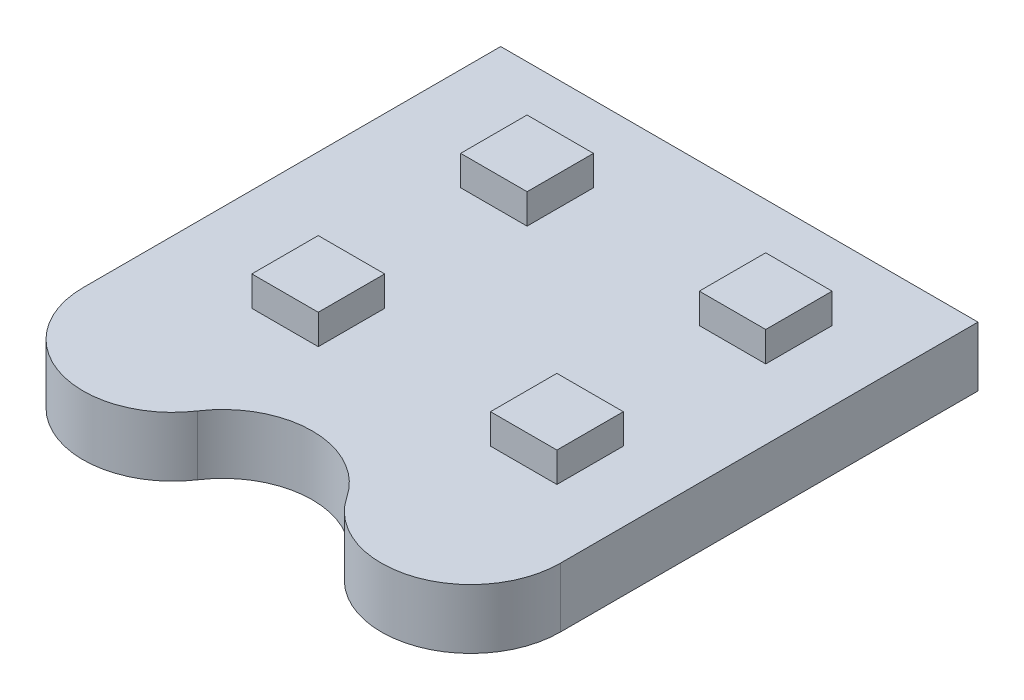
ISO-10303-21;
HEADER;
FILE_DESCRIPTION(('STEP AP214'),'2;1');
FILE_NAME('part.step','',(''),(''),'','','');
FILE_SCHEMA(('AUTOMOTIVE_DESIGN { 1 0 10303 214 1 1 1 1 }'));
ENDSEC;
DATA;
#1=APPLICATION_CONTEXT('core data for automotive mechanical design processes');
#2=APPLICATION_PROTOCOL_DEFINITION('international standard','automotive_design',2000,#1);
#3=PRODUCT_CONTEXT('',#1,'mechanical');
#4=PRODUCT('Part','Part','',(#3));
#5=PRODUCT_RELATED_PRODUCT_CATEGORY('part','',(#4));
#6=PRODUCT_DEFINITION_FORMATION('','',#4);
#7=PRODUCT_DEFINITION_CONTEXT('part definition',#1,'design');
#8=PRODUCT_DEFINITION('design','',#6,#7);
#9=PRODUCT_DEFINITION_SHAPE('','',#8);
#10=(LENGTH_UNIT() NAMED_UNIT(*) SI_UNIT(.MILLI.,.METRE.));
#11=(NAMED_UNIT(*) PLANE_ANGLE_UNIT() SI_UNIT($,.RADIAN.));
#12=(NAMED_UNIT(*) SI_UNIT($,.STERADIAN.) SOLID_ANGLE_UNIT());
#13=UNCERTAINTY_MEASURE_WITH_UNIT(LENGTH_MEASURE(1.E-05),#10,'distance_accuracy_value','');
#14=(GEOMETRIC_REPRESENTATION_CONTEXT(3) GLOBAL_UNCERTAINTY_ASSIGNED_CONTEXT((#13)) GLOBAL_UNIT_ASSIGNED_CONTEXT((#10,
#11,#12)) REPRESENTATION_CONTEXT('',''));
#15=CARTESIAN_POINT('',(0.,0.,0.));
#16=DIRECTION('',(0.,0.,1.));
#17=DIRECTION('',(1.,0.,0.));
#18=AXIS2_PLACEMENT_3D('',#15,#16,#17);
#19=CARTESIAN_POINT('',(19.05,12.7,88.9));
#20=DIRECTION('',(0.,1.,0.));
#21=DIRECTION('',(0.,0.,1.));
#22=AXIS2_PLACEMENT_3D('',#19,#20,#21);
#23=PLANE('',#22);
#24=DIRECTION('',(-1.,0.,0.));
#25=VECTOR('',#24,1.);
#26=CARTESIAN_POINT('',(86.7219282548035,12.7,16.173727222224));
#27=LINE('',#26,#25);
#28=CARTESIAN_POINT('',(86.7219282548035,12.7,16.173727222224));
#29=VERTEX_POINT('',#28);
#30=CARTESIAN_POINT('',(72.5799877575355,12.7,16.173727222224));
#31=VERTEX_POINT('',#30);
#32=EDGE_CURVE('E223',#29,#31,#27,.T.);
#33=ORIENTED_EDGE('',*,*,#32,.F.);
#34=DIRECTION('',(0.,0.,-1.));
#35=VECTOR('',#34,1.);
#36=CARTESIAN_POINT('',(86.7219282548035,12.7,16.173727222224));
#37=LINE('',#36,#35);
#38=CARTESIAN_POINT('',(86.7219282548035,12.7,30.3064055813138));
#39=VERTEX_POINT('',#38);
#40=EDGE_CURVE('E216',#39,#29,#37,.T.);
#41=ORIENTED_EDGE('',*,*,#40,.F.);
#42=DIRECTION('',(1.,0.,0.));
#43=VECTOR('',#42,1.);
#44=CARTESIAN_POINT('',(86.7219282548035,12.7,30.3064055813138));
#45=LINE('',#44,#43);
#46=CARTESIAN_POINT('',(72.5799877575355,12.7,30.3064055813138));
#47=VERTEX_POINT('',#46);
#48=EDGE_CURVE('E228',#47,#39,#45,.T.);
#49=ORIENTED_EDGE('',*,*,#48,.F.);
#50=DIRECTION('',(0.,0.,1.));
#51=VECTOR('',#50,1.);
#52=CARTESIAN_POINT('',(72.5799877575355,12.7,16.173727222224));
#53=LINE('',#52,#51);
#54=EDGE_CURVE('E225',#31,#47,#53,.T.);
#55=ORIENTED_EDGE('',*,*,#54,.F.);
#56=EDGE_LOOP('',(#33,#41,#49,#55));
#57=FACE_BOUND('',#56,.T.);
#58=CARTESIAN_POINT('',(19.05,12.7,88.9));
#59=DIRECTION('',(0.,1.,0.));
#60=DIRECTION('',(0.,0.,1.));
#61=AXIS2_PLACEMENT_3D('',#58,#59,#60);
#62=CIRCLE('',#61,19.05);
#63=CARTESIAN_POINT('',(0.,12.7,88.9));
#64=VERTEX_POINT('',#63);
#65=CARTESIAN_POINT('',(34.925,12.7,99.4302837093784));
#66=VERTEX_POINT('',#65);
#67=EDGE_CURVE('E262',#64,#66,#62,.T.);
#68=ORIENTED_EDGE('',*,*,#67,.T.);
#69=CARTESIAN_POINT('',(50.8,12.7,109.960567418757));
#70=DIRECTION('',(0.,-1.,0.));
#71=DIRECTION('',(0.,0.,-1.));
#72=AXIS2_PLACEMENT_3D('',#69,#70,#71);
#73=CIRCLE('',#72,19.05);
#74=CARTESIAN_POINT('',(66.675,12.7,99.4302837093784));
#75=VERTEX_POINT('',#74);
#76=EDGE_CURVE('E265',#66,#75,#73,.T.);
#77=ORIENTED_EDGE('',*,*,#76,.T.);
#78=CARTESIAN_POINT('',(82.55,12.7,88.9));
#79=DIRECTION('',(0.,1.,0.));
#80=DIRECTION('',(0.,0.,1.));
#81=AXIS2_PLACEMENT_3D('',#78,#79,#80);
#82=CIRCLE('',#81,19.05);
#83=CARTESIAN_POINT('',(101.6,12.7,88.9));
#84=VERTEX_POINT('',#83);
#85=EDGE_CURVE('E267',#75,#84,#82,.T.);
#86=ORIENTED_EDGE('',*,*,#85,.T.);
#87=DIRECTION('',(0.,0.,-1.));
#88=VECTOR('',#87,1.);
#89=CARTESIAN_POINT('',(101.6,12.7,0.));
#90=LINE('',#89,#88);
#91=CARTESIAN_POINT('',(101.6,12.7,0.));
#92=VERTEX_POINT('',#91);
#93=EDGE_CURVE('E269',#84,#92,#90,.T.);
#94=ORIENTED_EDGE('',*,*,#93,.T.);
#95=DIRECTION('',(-1.,0.,0.));
#96=VECTOR('',#95,1.);
#97=CARTESIAN_POINT('',(0.,12.7,0.));
#98=LINE('',#97,#96);
#99=CARTESIAN_POINT('',(0.,12.7,0.));
#100=VERTEX_POINT('',#99);
#101=EDGE_CURVE('E271',#92,#100,#98,.T.);
#102=ORIENTED_EDGE('',*,*,#101,.T.);
#103=DIRECTION('',(0.,0.,1.));
#104=VECTOR('',#103,1.);
#105=CARTESIAN_POINT('',(0.,12.7,88.9));
#106=LINE('',#105,#104);
#107=EDGE_CURVE('E273',#100,#64,#106,.T.);
#108=ORIENTED_EDGE('',*,*,#107,.T.);
#109=EDGE_LOOP('',(#68,#77,#86,#94,#102,#108));
#110=FACE_BOUND('',#109,.T.);
#111=DIRECTION('',(-1.,0.,0.));
#112=VECTOR('',#111,1.);
#113=CARTESIAN_POINT('',(86.7219282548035,12.7,60.623727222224));
#114=LINE('',#113,#112);
#115=CARTESIAN_POINT('',(86.7219282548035,12.7,60.623727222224));
#116=VERTEX_POINT('',#115);
#117=CARTESIAN_POINT('',(72.5799877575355,12.7,60.623727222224));
#118=VERTEX_POINT('',#117);
#119=EDGE_CURVE('E214',#116,#118,#114,.T.);
#120=ORIENTED_EDGE('',*,*,#119,.F.);
#121=DIRECTION('',(0.,0.,-1.));
#122=VECTOR('',#121,1.);
#123=CARTESIAN_POINT('',(86.7219282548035,12.7,60.623727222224));
#124=LINE('',#123,#122);
#125=CARTESIAN_POINT('',(86.7219282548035,12.7,74.7564055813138));
#126=VERTEX_POINT('',#125);
#127=EDGE_CURVE('E212',#126,#116,#124,.T.);
#128=ORIENTED_EDGE('',*,*,#127,.F.);
#129=DIRECTION('',(1.,0.,0.));
#130=VECTOR('',#129,1.);
#131=CARTESIAN_POINT('',(86.7219282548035,12.7,74.7564055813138));
#132=LINE('',#131,#130);
#133=CARTESIAN_POINT('',(72.5799877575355,12.7,74.7564055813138));
#134=VERTEX_POINT('',#133);
#135=EDGE_CURVE('E199',#134,#126,#132,.T.);
#136=ORIENTED_EDGE('',*,*,#135,.F.);
#137=DIRECTION('',(0.,0.,1.));
#138=VECTOR('',#137,1.);
#139=CARTESIAN_POINT('',(72.5799877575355,12.7,60.623727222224));
#140=LINE('',#139,#138);
#141=EDGE_CURVE('E604',#118,#134,#140,.T.);
#142=ORIENTED_EDGE('',*,*,#141,.F.);
#143=EDGE_LOOP('',(#120,#128,#136,#142));
#144=FACE_BOUND('',#143,.T.);
#145=DIRECTION('',(0.,0.,-1.));
#146=VECTOR('',#145,1.);
#147=CARTESIAN_POINT('',(35.9219282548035,12.7,16.173727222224));
#148=LINE('',#147,#146);
#149=CARTESIAN_POINT('',(35.9219282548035,12.7,30.3064055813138));
#150=VERTEX_POINT('',#149);
#151=CARTESIAN_POINT('',(35.9219282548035,12.7,16.173727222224));
#152=VERTEX_POINT('',#151);
#153=EDGE_CURVE('E293',#150,#152,#148,.T.);
#154=ORIENTED_EDGE('',*,*,#153,.F.);
#155=DIRECTION('',(1.,0.,0.));
#156=VECTOR('',#155,1.);
#157=CARTESIAN_POINT('',(35.9219282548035,12.7,30.3064055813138));
#158=LINE('',#157,#156);
#159=CARTESIAN_POINT('',(21.7799877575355,12.7,30.3064055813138));
#160=VERTEX_POINT('',#159);
#161=EDGE_CURVE('E295',#160,#150,#158,.T.);
#162=ORIENTED_EDGE('',*,*,#161,.F.);
#163=DIRECTION('',(0.,0.,1.));
#164=VECTOR('',#163,1.);
#165=CARTESIAN_POINT('',(21.7799877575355,12.7,16.173727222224));
#166=LINE('',#165,#164);
#167=CARTESIAN_POINT('',(21.7799877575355,12.7,16.173727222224));
#168=VERTEX_POINT('',#167);
#169=EDGE_CURVE('E298',#168,#160,#166,.T.);
#170=ORIENTED_EDGE('',*,*,#169,.F.);
#171=DIRECTION('',(-1.,0.,0.));
#172=VECTOR('',#171,1.);
#173=CARTESIAN_POINT('',(35.9219282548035,12.7,16.173727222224));
#174=LINE('',#173,#172);
#175=EDGE_CURVE('E301',#152,#168,#174,.T.);
#176=ORIENTED_EDGE('',*,*,#175,.F.);
#177=EDGE_LOOP('',(#154,#162,#170,#176));
#178=FACE_BOUND('',#177,.T.);
#179=DIRECTION('',(0.,0.,-1.));
#180=VECTOR('',#179,1.);
#181=CARTESIAN_POINT('',(35.9219282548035,12.7,60.623727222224));
#182=LINE('',#181,#180);
#183=CARTESIAN_POINT('',(35.9219282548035,12.7,74.7564055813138));
#184=VERTEX_POINT('',#183);
#185=CARTESIAN_POINT('',(35.9219282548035,12.7,60.623727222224));
#186=VERTEX_POINT('',#185);
#187=EDGE_CURVE('E328',#184,#186,#182,.T.);
#188=ORIENTED_EDGE('',*,*,#187,.F.);
#189=DIRECTION('',(1.,0.,0.));
#190=VECTOR('',#189,1.);
#191=CARTESIAN_POINT('',(35.9219282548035,12.7,74.7564055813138));
#192=LINE('',#191,#190);
#193=CARTESIAN_POINT('',(21.7799877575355,12.7,74.7564055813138));
#194=VERTEX_POINT('',#193);
#195=EDGE_CURVE('E330',#194,#184,#192,.T.);
#196=ORIENTED_EDGE('',*,*,#195,.F.);
#197=DIRECTION('',(0.,0.,1.));
#198=VECTOR('',#197,1.);
#199=CARTESIAN_POINT('',(21.7799877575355,12.7,60.623727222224));
#200=LINE('',#199,#198);
#201=CARTESIAN_POINT('',(21.7799877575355,12.7,60.623727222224));
#202=VERTEX_POINT('',#201);
#203=EDGE_CURVE('E333',#202,#194,#200,.T.);
#204=ORIENTED_EDGE('',*,*,#203,.F.);
#205=DIRECTION('',(-1.,0.,0.));
#206=VECTOR('',#205,1.);
#207=CARTESIAN_POINT('',(35.9219282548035,12.7,60.623727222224));
#208=LINE('',#207,#206);
#209=EDGE_CURVE('E335',#186,#202,#208,.T.);
#210=ORIENTED_EDGE('',*,*,#209,.F.);
#211=EDGE_LOOP('',(#188,#196,#204,#210));
#212=FACE_BOUND('',#211,.T.);
#213=ADVANCED_FACE('F36',(#57,#110,#144,#178,#212),#23,.T.);
#214=CARTESIAN_POINT('',(19.05,12.7,88.9));
#215=DIRECTION('',(0.,-1.,0.));
#216=DIRECTION('',(0.,0.,-1.));
#217=AXIS2_PLACEMENT_3D('',#214,#215,#216);
#218=CYLINDRICAL_SURFACE('',#217,19.05);
#219=CARTESIAN_POINT('',(19.05,0.,88.9));
#220=DIRECTION('',(0.,1.,0.));
#221=DIRECTION('',(0.,0.,1.));
#222=AXIS2_PLACEMENT_3D('',#219,#220,#221);
#223=CIRCLE('',#222,19.05);
#224=CARTESIAN_POINT('',(0.,0.,88.9));
#225=VERTEX_POINT('',#224);
#226=CARTESIAN_POINT('',(34.925,0.,99.4302837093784));
#227=VERTEX_POINT('',#226);
#228=EDGE_CURVE('E249',#225,#227,#223,.T.);
#229=ORIENTED_EDGE('',*,*,#228,.T.);
#230=DIRECTION('',(0.,-1.,0.));
#231=VECTOR('',#230,1.);
#232=CARTESIAN_POINT('',(34.925,12.7,99.4302837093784));
#233=LINE('',#232,#231);
#234=EDGE_CURVE('E290',#66,#227,#233,.T.);
#235=ORIENTED_EDGE('',*,*,#234,.F.);
#236=ORIENTED_EDGE('',*,*,#67,.F.);
#237=DIRECTION('',(0.,-1.,0.));
#238=VECTOR('',#237,1.);
#239=CARTESIAN_POINT('',(0.,12.7,88.9));
#240=LINE('',#239,#238);
#241=EDGE_CURVE('E275',#64,#225,#240,.T.);
#242=ORIENTED_EDGE('',*,*,#241,.T.);
#243=EDGE_LOOP('',(#229,#235,#236,#242));
#244=FACE_BOUND('',#243,.T.);
#245=ADVANCED_FACE('F361',(#244),#218,.T.);
#246=CARTESIAN_POINT('',(50.8,12.7,109.960567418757));
#247=DIRECTION('',(0.,-1.,0.));
#248=DIRECTION('',(0.,0.,-1.));
#249=AXIS2_PLACEMENT_3D('',#246,#247,#248);
#250=CYLINDRICAL_SURFACE('',#249,19.05);
#251=CARTESIAN_POINT('',(50.8,0.,109.960567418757));
#252=DIRECTION('',(0.,-1.,0.));
#253=DIRECTION('',(0.,0.,-1.));
#254=AXIS2_PLACEMENT_3D('',#251,#252,#253);
#255=CIRCLE('',#254,19.05);
#256=CARTESIAN_POINT('',(66.675,0.,99.4302837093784));
#257=VERTEX_POINT('',#256);
#258=EDGE_CURVE('E252',#227,#257,#255,.T.);
#259=ORIENTED_EDGE('',*,*,#258,.T.);
#260=DIRECTION('',(0.,-1.,0.));
#261=VECTOR('',#260,1.);
#262=CARTESIAN_POINT('',(66.675,12.7,99.4302837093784));
#263=LINE('',#262,#261);
#264=EDGE_CURVE('E287',#75,#257,#263,.T.);
#265=ORIENTED_EDGE('',*,*,#264,.F.);
#266=ORIENTED_EDGE('',*,*,#76,.F.);
#267=ORIENTED_EDGE('',*,*,#234,.T.);
#268=EDGE_LOOP('',(#259,#265,#266,#267));
#269=FACE_BOUND('',#268,.T.);
#270=ADVANCED_FACE('F369',(#269),#250,.F.);
#271=CARTESIAN_POINT('',(82.55,12.7,88.9));
#272=DIRECTION('',(0.,-1.,0.));
#273=DIRECTION('',(0.,0.,-1.));
#274=AXIS2_PLACEMENT_3D('',#271,#272,#273);
#275=CYLINDRICAL_SURFACE('',#274,19.05);
#276=CARTESIAN_POINT('',(82.55,0.,88.9));
#277=DIRECTION('',(0.,1.,0.));
#278=DIRECTION('',(0.,0.,1.));
#279=AXIS2_PLACEMENT_3D('',#276,#277,#278);
#280=CIRCLE('',#279,19.05);
#281=CARTESIAN_POINT('',(101.6,0.,88.9));
#282=VERTEX_POINT('',#281);
#283=EDGE_CURVE('E254',#257,#282,#280,.T.);
#284=ORIENTED_EDGE('',*,*,#283,.T.);
#285=DIRECTION('',(0.,-1.,0.));
#286=VECTOR('',#285,1.);
#287=CARTESIAN_POINT('',(101.6,12.7,88.9));
#288=LINE('',#287,#286);
#289=EDGE_CURVE('E284',#84,#282,#288,.T.);
#290=ORIENTED_EDGE('',*,*,#289,.F.);
#291=ORIENTED_EDGE('',*,*,#85,.F.);
#292=ORIENTED_EDGE('',*,*,#264,.T.);
#293=EDGE_LOOP('',(#284,#290,#291,#292));
#294=FACE_BOUND('',#293,.T.);
#295=ADVANCED_FACE('F389',(#294),#275,.T.);
#296=CARTESIAN_POINT('',(101.6,12.7,0.));
#297=DIRECTION('',(-1.,0.,0.));
#298=DIRECTION('',(0.,0.,1.));
#299=AXIS2_PLACEMENT_3D('',#296,#297,#298);
#300=PLANE('',#299);
#301=DIRECTION('',(0.,0.,-1.));
#302=VECTOR('',#301,1.);
#303=CARTESIAN_POINT('',(101.6,0.,0.));
#304=LINE('',#303,#302);
#305=CARTESIAN_POINT('',(101.6,0.,0.));
#306=VERTEX_POINT('',#305);
#307=EDGE_CURVE('E256',#282,#306,#304,.T.);
#308=ORIENTED_EDGE('',*,*,#307,.T.);
#309=DIRECTION('',(0.,-1.,0.));
#310=VECTOR('',#309,1.);
#311=CARTESIAN_POINT('',(101.6,12.7,0.));
#312=LINE('',#311,#310);
#313=EDGE_CURVE('E281',#92,#306,#312,.T.);
#314=ORIENTED_EDGE('',*,*,#313,.F.);
#315=ORIENTED_EDGE('',*,*,#93,.F.);
#316=ORIENTED_EDGE('',*,*,#289,.T.);
#317=EDGE_LOOP('',(#308,#314,#315,#316));
#318=FACE_BOUND('',#317,.T.);
#319=ADVANCED_FACE('F385',(#318),#300,.F.);
#320=CARTESIAN_POINT('',(0.,12.7,0.));
#321=DIRECTION('',(0.,0.,1.));
#322=DIRECTION('',(1.,0.,0.));
#323=AXIS2_PLACEMENT_3D('',#320,#321,#322);
#324=PLANE('',#323);
#325=DIRECTION('',(-1.,0.,0.));
#326=VECTOR('',#325,1.);
#327=CARTESIAN_POINT('',(0.,0.,0.));
#328=LINE('',#327,#326);
#329=CARTESIAN_POINT('',(0.,0.,0.));
#330=VERTEX_POINT('',#329);
#331=EDGE_CURVE('E258',#306,#330,#328,.T.);
#332=ORIENTED_EDGE('',*,*,#331,.T.);
#333=DIRECTION('',(0.,-1.,0.));
#334=VECTOR('',#333,1.);
#335=CARTESIAN_POINT('',(0.,12.7,0.));
#336=LINE('',#335,#334);
#337=EDGE_CURVE('E278',#100,#330,#336,.T.);
#338=ORIENTED_EDGE('',*,*,#337,.F.);
#339=ORIENTED_EDGE('',*,*,#101,.F.);
#340=ORIENTED_EDGE('',*,*,#313,.T.);
#341=EDGE_LOOP('',(#332,#338,#339,#340));
#342=FACE_BOUND('',#341,.T.);
#343=ADVANCED_FACE('F381',(#342),#324,.F.);
#344=CARTESIAN_POINT('',(0.,12.7,88.9));
#345=DIRECTION('',(1.,0.,0.));
#346=DIRECTION('',(0.,0.,-1.));
#347=AXIS2_PLACEMENT_3D('',#344,#345,#346);
#348=PLANE('',#347);
#349=DIRECTION('',(0.,0.,1.));
#350=VECTOR('',#349,1.);
#351=CARTESIAN_POINT('',(0.,0.,88.9));
#352=LINE('',#351,#350);
#353=EDGE_CURVE('E260',#330,#225,#352,.T.);
#354=ORIENTED_EDGE('',*,*,#353,.T.);
#355=ORIENTED_EDGE('',*,*,#241,.F.);
#356=ORIENTED_EDGE('',*,*,#107,.F.);
#357=ORIENTED_EDGE('',*,*,#337,.T.);
#358=EDGE_LOOP('',(#354,#355,#356,#357));
#359=FACE_BOUND('',#358,.T.);
#360=ADVANCED_FACE('F378',(#359),#348,.F.);
#361=CARTESIAN_POINT('',(19.05,0.,88.9));
#362=DIRECTION('',(0.,1.,0.));
#363=DIRECTION('',(0.,0.,1.));
#364=AXIS2_PLACEMENT_3D('',#361,#362,#363);
#365=PLANE('',#364);
#366=ORIENTED_EDGE('',*,*,#228,.F.);
#367=ORIENTED_EDGE('',*,*,#353,.F.);
#368=ORIENTED_EDGE('',*,*,#331,.F.);
#369=ORIENTED_EDGE('',*,*,#307,.F.);
#370=ORIENTED_EDGE('',*,*,#283,.F.);
#371=ORIENTED_EDGE('',*,*,#258,.F.);
#372=EDGE_LOOP('',(#366,#367,#368,#369,#370,#371));
#373=FACE_BOUND('',#372,.T.);
#374=ADVANCED_FACE('F376',(#373),#365,.F.);
#375=CARTESIAN_POINT('',(86.7219282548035,19.05,16.173727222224));
#376=DIRECTION('',(-1.,0.,0.));
#377=DIRECTION('',(0.,0.,1.));
#378=AXIS2_PLACEMENT_3D('',#375,#376,#377);
#379=PLANE('',#378);
#380=ORIENTED_EDGE('',*,*,#40,.T.);
#381=DIRECTION('',(0.,-1.,0.));
#382=VECTOR('',#381,1.);
#383=CARTESIAN_POINT('',(86.7219282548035,19.05,16.173727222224));
#384=LINE('',#383,#382);
#385=CARTESIAN_POINT('',(86.7219282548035,19.05,16.173727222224));
#386=VERTEX_POINT('',#385);
#387=EDGE_CURVE('E247',#386,#29,#384,.T.);
#388=ORIENTED_EDGE('',*,*,#387,.F.);
#389=DIRECTION('',(0.,0.,-1.));
#390=VECTOR('',#389,1.);
#391=CARTESIAN_POINT('',(86.7219282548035,19.05,16.173727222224));
#392=LINE('',#391,#390);
#393=CARTESIAN_POINT('',(86.7219282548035,19.05,30.3064055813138));
#394=VERTEX_POINT('',#393);
#395=EDGE_CURVE('E230',#394,#386,#392,.T.);
#396=ORIENTED_EDGE('',*,*,#395,.F.);
#397=DIRECTION('',(0.,-1.,0.));
#398=VECTOR('',#397,1.);
#399=CARTESIAN_POINT('',(86.7219282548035,19.05,30.3064055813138));
#400=LINE('',#399,#398);
#401=EDGE_CURVE('E239',#394,#39,#400,.T.);
#402=ORIENTED_EDGE('',*,*,#401,.T.);
#403=EDGE_LOOP('',(#380,#388,#396,#402));
#404=FACE_BOUND('',#403,.T.);
#405=ADVANCED_FACE('F528',(#404),#379,.F.);
#406=CARTESIAN_POINT('',(86.7219282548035,19.05,16.173727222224));
#407=DIRECTION('',(0.,0.,1.));
#408=DIRECTION('',(1.,0.,0.));
#409=AXIS2_PLACEMENT_3D('',#406,#407,#408);
#410=PLANE('',#409);
#411=ORIENTED_EDGE('',*,*,#32,.T.);
#412=DIRECTION('',(0.,-1.,0.));
#413=VECTOR('',#412,1.);
#414=CARTESIAN_POINT('',(72.5799877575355,19.05,16.173727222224));
#415=LINE('',#414,#413);
#416=CARTESIAN_POINT('',(72.5799877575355,19.05,16.173727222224));
#417=VERTEX_POINT('',#416);
#418=EDGE_CURVE('E244',#417,#31,#415,.T.);
#419=ORIENTED_EDGE('',*,*,#418,.F.);
#420=DIRECTION('',(-1.,0.,0.));
#421=VECTOR('',#420,1.);
#422=CARTESIAN_POINT('',(86.7219282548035,19.05,16.173727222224));
#423=LINE('',#422,#421);
#424=EDGE_CURVE('E233',#386,#417,#423,.T.);
#425=ORIENTED_EDGE('',*,*,#424,.F.);
#426=ORIENTED_EDGE('',*,*,#387,.T.);
#427=EDGE_LOOP('',(#411,#419,#425,#426));
#428=FACE_BOUND('',#427,.T.);
#429=ADVANCED_FACE('F520',(#428),#410,.F.);
#430=CARTESIAN_POINT('',(72.5799877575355,19.05,16.173727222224));
#431=DIRECTION('',(1.,0.,0.));
#432=DIRECTION('',(0.,0.,-1.));
#433=AXIS2_PLACEMENT_3D('',#430,#431,#432);
#434=PLANE('',#433);
#435=ORIENTED_EDGE('',*,*,#54,.T.);
#436=DIRECTION('',(0.,-1.,0.));
#437=VECTOR('',#436,1.);
#438=CARTESIAN_POINT('',(72.5799877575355,19.05,30.3064055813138));
#439=LINE('',#438,#437);
#440=CARTESIAN_POINT('',(72.5799877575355,19.05,30.3064055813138));
#441=VERTEX_POINT('',#440);
#442=EDGE_CURVE('E242',#441,#47,#439,.T.);
#443=ORIENTED_EDGE('',*,*,#442,.F.);
#444=DIRECTION('',(0.,0.,1.));
#445=VECTOR('',#444,1.);
#446=CARTESIAN_POINT('',(72.5799877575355,19.05,16.173727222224));
#447=LINE('',#446,#445);
#448=EDGE_CURVE('E235',#417,#441,#447,.T.);
#449=ORIENTED_EDGE('',*,*,#448,.F.);
#450=ORIENTED_EDGE('',*,*,#418,.T.);
#451=EDGE_LOOP('',(#435,#443,#449,#450));
#452=FACE_BOUND('',#451,.T.);
#453=ADVANCED_FACE('F512',(#452),#434,.F.);
#454=CARTESIAN_POINT('',(86.7219282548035,19.05,30.3064055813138));
#455=DIRECTION('',(0.,0.,-1.));
#456=DIRECTION('',(-1.,0.,0.));
#457=AXIS2_PLACEMENT_3D('',#454,#455,#456);
#458=PLANE('',#457);
#459=ORIENTED_EDGE('',*,*,#48,.T.);
#460=ORIENTED_EDGE('',*,*,#401,.F.);
#461=DIRECTION('',(1.,0.,0.));
#462=VECTOR('',#461,1.);
#463=CARTESIAN_POINT('',(86.7219282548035,19.05,30.3064055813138));
#464=LINE('',#463,#462);
#465=EDGE_CURVE('E237',#441,#394,#464,.T.);
#466=ORIENTED_EDGE('',*,*,#465,.F.);
#467=ORIENTED_EDGE('',*,*,#442,.T.);
#468=EDGE_LOOP('',(#459,#460,#466,#467));
#469=FACE_BOUND('',#468,.T.);
#470=ADVANCED_FACE('F505',(#469),#458,.F.);
#471=CARTESIAN_POINT('',(86.7219282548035,19.05,30.3064055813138));
#472=DIRECTION('',(0.,-1.,0.));
#473=DIRECTION('',(0.,0.,-1.));
#474=AXIS2_PLACEMENT_3D('',#471,#472,#473);
#475=PLANE('',#474);
#476=ORIENTED_EDGE('',*,*,#395,.T.);
#477=ORIENTED_EDGE('',*,*,#424,.T.);
#478=ORIENTED_EDGE('',*,*,#448,.T.);
#479=ORIENTED_EDGE('',*,*,#465,.T.);
#480=EDGE_LOOP('',(#476,#477,#478,#479));
#481=FACE_BOUND('',#480,.T.);
#482=ADVANCED_FACE('F456',(#481),#475,.F.);
#483=CARTESIAN_POINT('',(86.7219282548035,19.05,60.623727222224));
#484=DIRECTION('',(-1.,0.,0.));
#485=DIRECTION('',(0.,0.,1.));
#486=AXIS2_PLACEMENT_3D('',#483,#484,#485);
#487=PLANE('',#486);
#488=ORIENTED_EDGE('',*,*,#127,.T.);
#489=DIRECTION('',(0.,-1.,0.));
#490=VECTOR('',#489,1.);
#491=CARTESIAN_POINT('',(86.7219282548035,19.05,60.623727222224));
#492=LINE('',#491,#490);
#493=CARTESIAN_POINT('',(86.7219282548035,19.05,60.623727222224));
#494=VERTEX_POINT('',#493);
#495=EDGE_CURVE('E205',#494,#116,#492,.T.);
#496=ORIENTED_EDGE('',*,*,#495,.F.);
#497=DIRECTION('',(0.,0.,-1.));
#498=VECTOR('',#497,1.);
#499=CARTESIAN_POINT('',(86.7219282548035,19.05,60.623727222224));
#500=LINE('',#499,#498);
#501=CARTESIAN_POINT('',(86.7219282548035,19.05,74.7564055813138));
#502=VERTEX_POINT('',#501);
#503=EDGE_CURVE('E188',#502,#494,#500,.T.);
#504=ORIENTED_EDGE('',*,*,#503,.F.);
#505=DIRECTION('',(0.,-1.,0.));
#506=VECTOR('',#505,1.);
#507=CARTESIAN_POINT('',(86.7219282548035,19.05,74.7564055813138));
#508=LINE('',#507,#506);
#509=EDGE_CURVE('E609',#502,#126,#508,.T.);
#510=ORIENTED_EDGE('',*,*,#509,.T.);
#511=EDGE_LOOP('',(#488,#496,#504,#510));
#512=FACE_BOUND('',#511,.T.);
#513=ADVANCED_FACE('F210',(#512),#487,.F.);
#514=CARTESIAN_POINT('',(86.7219282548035,19.05,60.623727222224));
#515=DIRECTION('',(0.,0.,1.));
#516=DIRECTION('',(1.,0.,0.));
#517=AXIS2_PLACEMENT_3D('',#514,#515,#516);
#518=PLANE('',#517);
#519=ORIENTED_EDGE('',*,*,#119,.T.);
#520=DIRECTION('',(0.,-1.,0.));
#521=VECTOR('',#520,1.);
#522=CARTESIAN_POINT('',(72.5799877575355,19.05,60.623727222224));
#523=LINE('',#522,#521);
#524=CARTESIAN_POINT('',(72.5799877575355,19.05,60.623727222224));
#525=VERTEX_POINT('',#524);
#526=EDGE_CURVE('E207',#525,#118,#523,.T.);
#527=ORIENTED_EDGE('',*,*,#526,.F.);
#528=DIRECTION('',(-1.,0.,0.));
#529=VECTOR('',#528,1.);
#530=CARTESIAN_POINT('',(86.7219282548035,19.05,60.623727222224));
#531=LINE('',#530,#529);
#532=EDGE_CURVE('E191',#494,#525,#531,.T.);
#533=ORIENTED_EDGE('',*,*,#532,.F.);
#534=ORIENTED_EDGE('',*,*,#495,.T.);
#535=EDGE_LOOP('',(#519,#527,#533,#534));
#536=FACE_BOUND('',#535,.T.);
#537=ADVANCED_FACE('F204',(#536),#518,.F.);
#538=CARTESIAN_POINT('',(72.5799877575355,19.05,60.623727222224));
#539=DIRECTION('',(1.,0.,0.));
#540=DIRECTION('',(0.,0.,-1.));
#541=AXIS2_PLACEMENT_3D('',#538,#539,#540);
#542=PLANE('',#541);
#543=ORIENTED_EDGE('',*,*,#141,.T.);
#544=DIRECTION('',(0.,-1.,0.));
#545=VECTOR('',#544,1.);
#546=CARTESIAN_POINT('',(72.5799877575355,19.05,74.7564055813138));
#547=LINE('',#546,#545);
#548=CARTESIAN_POINT('',(72.5799877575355,19.05,74.7564055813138));
#549=VERTEX_POINT('',#548);
#550=EDGE_CURVE('E607',#549,#134,#547,.T.);
#551=ORIENTED_EDGE('',*,*,#550,.F.);
#552=DIRECTION('',(0.,0.,1.));
#553=VECTOR('',#552,1.);
#554=CARTESIAN_POINT('',(72.5799877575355,19.05,60.623727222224));
#555=LINE('',#554,#553);
#556=EDGE_CURVE('E208',#525,#549,#555,.T.);
#557=ORIENTED_EDGE('',*,*,#556,.F.);
#558=ORIENTED_EDGE('',*,*,#526,.T.);
#559=EDGE_LOOP('',(#543,#551,#557,#558));
#560=FACE_BOUND('',#559,.T.);
#561=ADVANCED_FACE('F462',(#560),#542,.F.);
#562=CARTESIAN_POINT('',(86.7219282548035,19.05,74.7564055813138));
#563=DIRECTION('',(0.,0.,-1.));
#564=DIRECTION('',(-1.,0.,0.));
#565=AXIS2_PLACEMENT_3D('',#562,#563,#564);
#566=PLANE('',#565);
#567=ORIENTED_EDGE('',*,*,#135,.T.);
#568=ORIENTED_EDGE('',*,*,#509,.F.);
#569=DIRECTION('',(1.,0.,0.));
#570=VECTOR('',#569,1.);
#571=CARTESIAN_POINT('',(86.7219282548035,19.05,74.7564055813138));
#572=LINE('',#571,#570);
#573=EDGE_CURVE('E194',#549,#502,#572,.T.);
#574=ORIENTED_EDGE('',*,*,#573,.F.);
#575=ORIENTED_EDGE('',*,*,#550,.T.);
#576=EDGE_LOOP('',(#567,#568,#574,#575));
#577=FACE_BOUND('',#576,.T.);
#578=ADVANCED_FACE('F454',(#577),#566,.F.);
#579=CARTESIAN_POINT('',(86.7219282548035,19.05,74.7564055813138));
#580=DIRECTION('',(0.,-1.,0.));
#581=DIRECTION('',(0.,0.,-1.));
#582=AXIS2_PLACEMENT_3D('',#579,#580,#581);
#583=PLANE('',#582);
#584=ORIENTED_EDGE('',*,*,#503,.T.);
#585=ORIENTED_EDGE('',*,*,#532,.T.);
#586=ORIENTED_EDGE('',*,*,#556,.T.);
#587=ORIENTED_EDGE('',*,*,#573,.T.);
#588=EDGE_LOOP('',(#584,#585,#586,#587));
#589=FACE_BOUND('',#588,.T.);
#590=ADVANCED_FACE('F190',(#589),#583,.F.);
#591=CARTESIAN_POINT('',(35.9219282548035,19.05,30.3064055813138));
#592=DIRECTION('',(0.,-1.,0.));
#593=DIRECTION('',(0.,0.,-1.));
#594=AXIS2_PLACEMENT_3D('',#591,#592,#593);
#595=PLANE('',#594);
#596=DIRECTION('',(0.,0.,-1.));
#597=VECTOR('',#596,1.);
#598=CARTESIAN_POINT('',(35.9219282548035,19.05,16.173727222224));
#599=LINE('',#598,#597);
#600=CARTESIAN_POINT('',(35.9219282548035,19.05,30.3064055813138));
#601=VERTEX_POINT('',#600);
#602=CARTESIAN_POINT('',(35.9219282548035,19.05,16.173727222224));
#603=VERTEX_POINT('',#602);
#604=EDGE_CURVE('E307',#601,#603,#599,.T.);
#605=ORIENTED_EDGE('',*,*,#604,.T.);
#606=DIRECTION('',(-1.,0.,0.));
#607=VECTOR('',#606,1.);
#608=CARTESIAN_POINT('',(35.9219282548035,19.05,16.173727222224));
#609=LINE('',#608,#607);
#610=CARTESIAN_POINT('',(21.7799877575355,19.05,16.173727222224));
#611=VERTEX_POINT('',#610);
#612=EDGE_CURVE('E316',#603,#611,#609,.T.);
#613=ORIENTED_EDGE('',*,*,#612,.T.);
#614=DIRECTION('',(0.,0.,1.));
#615=VECTOR('',#614,1.);
#616=CARTESIAN_POINT('',(21.7799877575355,19.05,16.173727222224));
#617=LINE('',#616,#615);
#618=CARTESIAN_POINT('',(21.7799877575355,19.05,30.3064055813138));
#619=VERTEX_POINT('',#618);
#620=EDGE_CURVE('E322',#611,#619,#617,.T.);
#621=ORIENTED_EDGE('',*,*,#620,.T.);
#622=DIRECTION('',(1.,0.,0.));
#623=VECTOR('',#622,1.);
#624=CARTESIAN_POINT('',(35.9219282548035,19.05,30.3064055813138));
#625=LINE('',#624,#623);
#626=EDGE_CURVE('E325',#619,#601,#625,.T.);
#627=ORIENTED_EDGE('',*,*,#626,.T.);
#628=EDGE_LOOP('',(#605,#613,#621,#627));
#629=FACE_BOUND('',#628,.T.);
#630=ADVANCED_FACE('F412',(#629),#595,.F.);
#631=CARTESIAN_POINT('',(35.9219282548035,19.05,30.3064055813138));
#632=DIRECTION('',(0.,0.,-1.));
#633=DIRECTION('',(-1.,0.,0.));
#634=AXIS2_PLACEMENT_3D('',#631,#632,#633);
#635=PLANE('',#634);
#636=ORIENTED_EDGE('',*,*,#161,.T.);
#637=DIRECTION('',(0.,-1.,0.));
#638=VECTOR('',#637,1.);
#639=CARTESIAN_POINT('',(35.9219282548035,19.05,30.3064055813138));
#640=LINE('',#639,#638);
#641=EDGE_CURVE('E310',#601,#150,#640,.T.);
#642=ORIENTED_EDGE('',*,*,#641,.F.);
#643=ORIENTED_EDGE('',*,*,#626,.F.);
#644=DIRECTION('',(0.,-1.,0.));
#645=VECTOR('',#644,1.);
#646=CARTESIAN_POINT('',(21.7799877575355,19.05,30.3064055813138));
#647=LINE('',#646,#645);
#648=EDGE_CURVE('E319',#619,#160,#647,.T.);
#649=ORIENTED_EDGE('',*,*,#648,.T.);
#650=EDGE_LOOP('',(#636,#642,#643,#649));
#651=FACE_BOUND('',#650,.T.);
#652=ADVANCED_FACE('F408',(#651),#635,.F.);
#653=CARTESIAN_POINT('',(21.7799877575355,19.05,16.173727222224));
#654=DIRECTION('',(1.,0.,0.));
#655=DIRECTION('',(0.,0.,-1.));
#656=AXIS2_PLACEMENT_3D('',#653,#654,#655);
#657=PLANE('',#656);
#658=ORIENTED_EDGE('',*,*,#169,.T.);
#659=ORIENTED_EDGE('',*,*,#648,.F.);
#660=ORIENTED_EDGE('',*,*,#620,.F.);
#661=DIRECTION('',(0.,-1.,0.));
#662=VECTOR('',#661,1.);
#663=CARTESIAN_POINT('',(21.7799877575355,19.05,16.173727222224));
#664=LINE('',#663,#662);
#665=EDGE_CURVE('E313',#611,#168,#664,.T.);
#666=ORIENTED_EDGE('',*,*,#665,.T.);
#667=EDGE_LOOP('',(#658,#659,#660,#666));
#668=FACE_BOUND('',#667,.T.);
#669=ADVANCED_FACE('F404',(#668),#657,.F.);
#670=CARTESIAN_POINT('',(35.9219282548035,19.05,16.173727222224));
#671=DIRECTION('',(0.,0.,1.));
#672=DIRECTION('',(1.,0.,0.));
#673=AXIS2_PLACEMENT_3D('',#670,#671,#672);
#674=PLANE('',#673);
#675=ORIENTED_EDGE('',*,*,#175,.T.);
#676=ORIENTED_EDGE('',*,*,#665,.F.);
#677=ORIENTED_EDGE('',*,*,#612,.F.);
#678=DIRECTION('',(0.,-1.,0.));
#679=VECTOR('',#678,1.);
#680=CARTESIAN_POINT('',(35.9219282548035,19.05,16.173727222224));
#681=LINE('',#680,#679);
#682=EDGE_CURVE('E304',#603,#152,#681,.T.);
#683=ORIENTED_EDGE('',*,*,#682,.T.);
#684=EDGE_LOOP('',(#675,#676,#677,#683));
#685=FACE_BOUND('',#684,.T.);
#686=ADVANCED_FACE('F400',(#685),#674,.F.);
#687=CARTESIAN_POINT('',(35.9219282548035,19.05,16.173727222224));
#688=DIRECTION('',(-1.,0.,0.));
#689=DIRECTION('',(0.,0.,1.));
#690=AXIS2_PLACEMENT_3D('',#687,#688,#689);
#691=PLANE('',#690);
#692=ORIENTED_EDGE('',*,*,#153,.T.);
#693=ORIENTED_EDGE('',*,*,#682,.F.);
#694=ORIENTED_EDGE('',*,*,#604,.F.);
#695=ORIENTED_EDGE('',*,*,#641,.T.);
#696=EDGE_LOOP('',(#692,#693,#694,#695));
#697=FACE_BOUND('',#696,.T.);
#698=ADVANCED_FACE('F397',(#697),#691,.F.);
#699=CARTESIAN_POINT('',(35.9219282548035,19.05,74.7564055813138));
#700=DIRECTION('',(0.,-1.,0.));
#701=DIRECTION('',(0.,0.,-1.));
#702=AXIS2_PLACEMENT_3D('',#699,#700,#701);
#703=PLANE('',#702);
#704=DIRECTION('',(0.,0.,-1.));
#705=VECTOR('',#704,1.);
#706=CARTESIAN_POINT('',(35.9219282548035,19.05,60.623727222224));
#707=LINE('',#706,#705);
#708=CARTESIAN_POINT('',(35.9219282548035,19.05,74.7564055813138));
#709=VERTEX_POINT('',#708);
#710=CARTESIAN_POINT('',(35.9219282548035,19.05,60.623727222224));
#711=VERTEX_POINT('',#710);
#712=EDGE_CURVE('E340',#709,#711,#707,.T.);
#713=ORIENTED_EDGE('',*,*,#712,.T.);
#714=DIRECTION('',(-1.,0.,0.));
#715=VECTOR('',#714,1.);
#716=CARTESIAN_POINT('',(35.9219282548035,19.05,60.623727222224));
#717=LINE('',#716,#715);
#718=CARTESIAN_POINT('',(21.7799877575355,19.05,60.623727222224));
#719=VERTEX_POINT('',#718);
#720=EDGE_CURVE('E347',#711,#719,#717,.T.);
#721=ORIENTED_EDGE('',*,*,#720,.T.);
#722=DIRECTION('',(0.,0.,1.));
#723=VECTOR('',#722,1.);
#724=CARTESIAN_POINT('',(21.7799877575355,19.05,60.623727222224));
#725=LINE('',#724,#723);
#726=CARTESIAN_POINT('',(21.7799877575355,19.05,74.7564055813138));
#727=VERTEX_POINT('',#726);
#728=EDGE_CURVE('E44',#719,#727,#725,.T.);
#729=ORIENTED_EDGE('',*,*,#728,.T.);
#730=DIRECTION('',(1.,0.,0.));
#731=VECTOR('',#730,1.);
#732=CARTESIAN_POINT('',(35.9219282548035,19.05,74.7564055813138));
#733=LINE('',#732,#731);
#734=EDGE_CURVE('E11',#727,#709,#733,.T.);
#735=ORIENTED_EDGE('',*,*,#734,.T.);
#736=EDGE_LOOP('',(#713,#721,#729,#735));
#737=FACE_BOUND('',#736,.T.);
#738=ADVANCED_FACE('F38',(#737),#703,.F.);
#739=CARTESIAN_POINT('',(35.9219282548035,19.05,74.7564055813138));
#740=DIRECTION('',(0.,0.,-1.));
#741=DIRECTION('',(-1.,0.,0.));
#742=AXIS2_PLACEMENT_3D('',#739,#740,#741);
#743=PLANE('',#742);
#744=ORIENTED_EDGE('',*,*,#195,.T.);
#745=DIRECTION('',(0.,-1.,0.));
#746=VECTOR('',#745,1.);
#747=CARTESIAN_POINT('',(35.9219282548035,19.05,74.7564055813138));
#748=LINE('',#747,#746);
#749=EDGE_CURVE('E343',#709,#184,#748,.T.);
#750=ORIENTED_EDGE('',*,*,#749,.F.);
#751=ORIENTED_EDGE('',*,*,#734,.F.);
#752=DIRECTION('',(0.,-1.,0.));
#753=VECTOR('',#752,1.);
#754=CARTESIAN_POINT('',(21.7799877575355,19.05,74.7564055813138));
#755=LINE('',#754,#753);
#756=EDGE_CURVE('E51',#727,#194,#755,.T.);
#757=ORIENTED_EDGE('',*,*,#756,.T.);
#758=EDGE_LOOP('',(#744,#750,#751,#757));
#759=FACE_BOUND('',#758,.T.);
#760=ADVANCED_FACE('F353',(#759),#743,.F.);
#761=CARTESIAN_POINT('',(21.7799877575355,19.05,60.623727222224));
#762=DIRECTION('',(1.,0.,0.));
#763=DIRECTION('',(0.,0.,-1.));
#764=AXIS2_PLACEMENT_3D('',#761,#762,#763);
#765=PLANE('',#764);
#766=ORIENTED_EDGE('',*,*,#203,.T.);
#767=ORIENTED_EDGE('',*,*,#756,.F.);
#768=ORIENTED_EDGE('',*,*,#728,.F.);
#769=DIRECTION('',(0.,-1.,0.));
#770=VECTOR('',#769,1.);
#771=CARTESIAN_POINT('',(21.7799877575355,19.05,60.623727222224));
#772=LINE('',#771,#770);
#773=EDGE_CURVE('E59',#719,#202,#772,.T.);
#774=ORIENTED_EDGE('',*,*,#773,.T.);
#775=EDGE_LOOP('',(#766,#767,#768,#774));
#776=FACE_BOUND('',#775,.T.);
#777=ADVANCED_FACE('F359',(#776),#765,.F.);
#778=CARTESIAN_POINT('',(35.9219282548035,19.05,60.623727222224));
#779=DIRECTION('',(0.,0.,1.));
#780=DIRECTION('',(1.,0.,0.));
#781=AXIS2_PLACEMENT_3D('',#778,#779,#780);
#782=PLANE('',#781);
#783=ORIENTED_EDGE('',*,*,#209,.T.);
#784=ORIENTED_EDGE('',*,*,#773,.F.);
#785=ORIENTED_EDGE('',*,*,#720,.F.);
#786=DIRECTION('',(0.,-1.,0.));
#787=VECTOR('',#786,1.);
#788=CARTESIAN_POINT('',(35.9219282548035,19.05,60.623727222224));
#789=LINE('',#788,#787);
#790=EDGE_CURVE('E337',#711,#186,#789,.T.);
#791=ORIENTED_EDGE('',*,*,#790,.T.);
#792=EDGE_LOOP('',(#783,#784,#785,#791));
#793=FACE_BOUND('',#792,.T.);
#794=ADVANCED_FACE('F357',(#793),#782,.F.);
#795=CARTESIAN_POINT('',(35.9219282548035,19.05,60.623727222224));
#796=DIRECTION('',(-1.,0.,0.));
#797=DIRECTION('',(0.,0.,1.));
#798=AXIS2_PLACEMENT_3D('',#795,#796,#797);
#799=PLANE('',#798);
#800=ORIENTED_EDGE('',*,*,#187,.T.);
#801=ORIENTED_EDGE('',*,*,#790,.F.);
#802=ORIENTED_EDGE('',*,*,#712,.F.);
#803=ORIENTED_EDGE('',*,*,#749,.T.);
#804=EDGE_LOOP('',(#800,#801,#802,#803));
#805=FACE_BOUND('',#804,.T.);
#806=ADVANCED_FACE('F355',(#805),#799,.F.);
#807=CLOSED_SHELL('',(#213,#245,#270,#295,#319,#343,#360,#374,#405,#429,#453,#470,#482,#513,
#537,#561,#578,#590,#630,#652,#669,#686,#698,#738,#760,#777,#794,#806));
#808=MANIFOLD_SOLID_BREP('B2',#807);
#809=ADVANCED_BREP_SHAPE_REPRESENTATION('',(#18,#808),#14);
#810=SHAPE_DEFINITION_REPRESENTATION(#9,#809);
ENDSEC;
END-ISO-10303-21;
